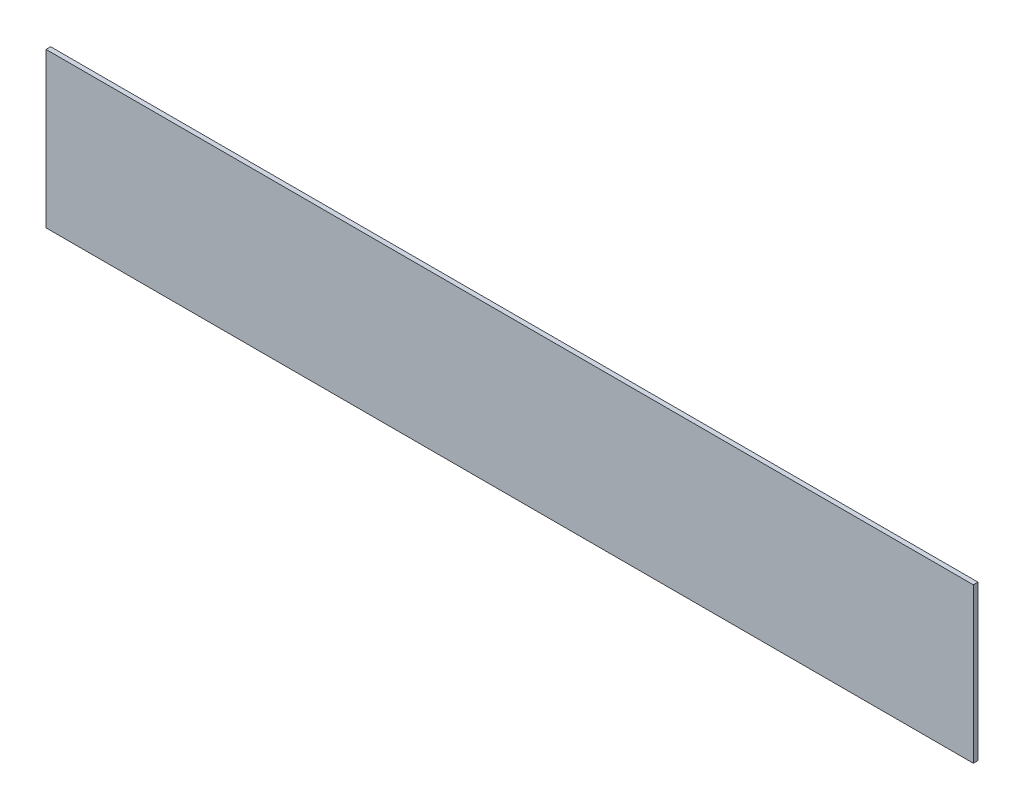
from build123d import *

# Parameters (mm, degrees)
SKETCH1_W      = 60
SKETCH1_H      = 10
EXTRUDE2_DEPTH = 0.3


with BuildPart() as part:
    # Sketch1 → Extrude2 (new body)
    with BuildSketch(Plane.XY):
        Rectangle(SKETCH1_W, SKETCH1_H)
    extrude(amount=EXTRUDE2_DEPTH)


solid = part.part
